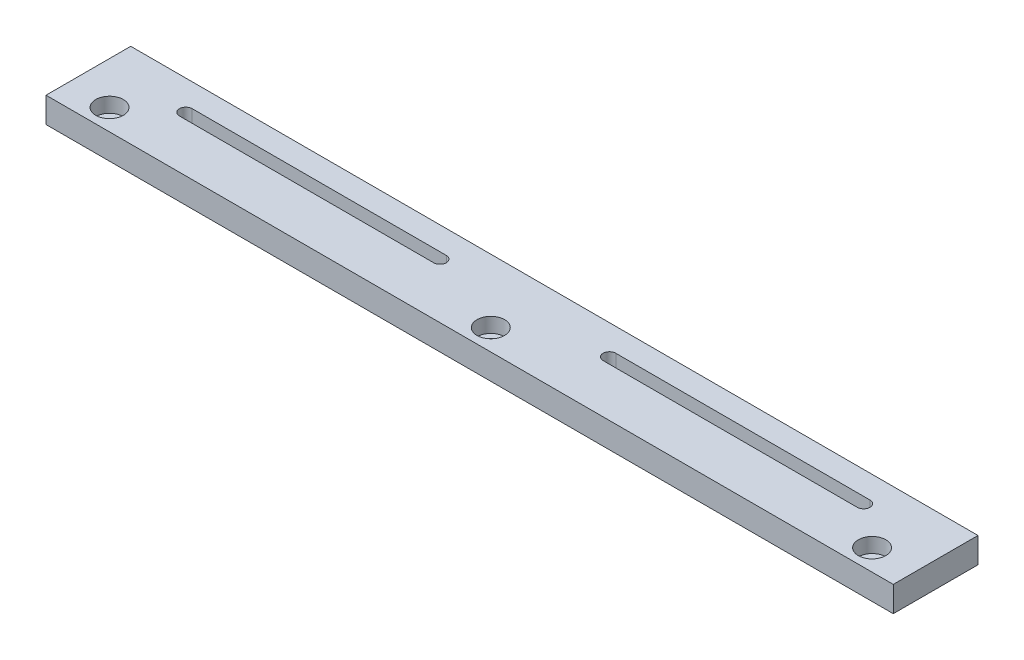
from build123d import *

# Parameters (mm, degrees)
SKETCH_1_W          = 200
SKETCH_1_H          = 6
EXTRUDE_1_DEPTH     = 20
SKETCH_2_R          = 1.75
CUT_EXTRUDE_1_DEPTH = 20
SKETCH_3_R          = 3.25
CUT_EXTRUDE_2_DEPTH = 3.5


with BuildPart() as part:
    # Sketch 1 → Extrude 1 (new body)
    with BuildSketch(Plane.XY):
        with Locations((100, 3)):
            Rectangle(SKETCH_1_W, SKETCH_1_H)
    extrude(amount=EXTRUDE_1_DEPTH)

    # Sketch 2 → Cut-Extrude 1 (cut)
    with BuildSketch(Plane(origin=(0, 6, 0), x_dir=(1, 0, 0), z_dir=(0, 1, 0))):
        with Locations(Location((10, -15, 0), (0, 0, 270))):
            Circle(SKETCH_2_R)
        with Locations(Location((100, -15, 0), (0, 0, 270))):
            Circle(SKETCH_2_R)
        with Locations(Location((190, -15, 0), (0, 0, 270))):
            Circle(SKETCH_2_R)
        with BuildLine():
            Line((20, -5.5), (80, -5.5))
            ThreePointArc((80, -5.5), (81.5, -7), (80, -8.5))
            Line((80, -8.5), (20, -8.5))
            ThreePointArc((20, -8.5), (18.5, -7), (20, -5.5))
        make_face()
        with BuildLine():
            Line((120, -8.5), (180, -8.5))
            ThreePointArc((180, -8.5), (181.5, -7), (180, -5.5))
            Line((180, -5.5), (120, -5.5))
            ThreePointArc((120, -5.5), (118.5, -7), (120, -8.5))
        make_face()
    extrude(amount=-CUT_EXTRUDE_1_DEPTH, mode=Mode.SUBTRACT)

    # Sketch 3 → Cut-Extrude 2 (cut)
    with BuildSketch(Plane(origin=(0, 6, 0), x_dir=(1, 0, 0), z_dir=(0, 1, 0))):
        with Locations(Location((10, -15, 0), (0, 0, 270))):
            Circle(SKETCH_3_R)
        with Locations(Location((100, -15, 0), (0, 0, 270))):
            Circle(SKETCH_3_R)
        with Locations(Location((190, -15, 0), (0, 0, 270))):
            Circle(SKETCH_3_R)
    extrude(amount=-CUT_EXTRUDE_2_DEPTH, mode=Mode.SUBTRACT)


solid = part.part
